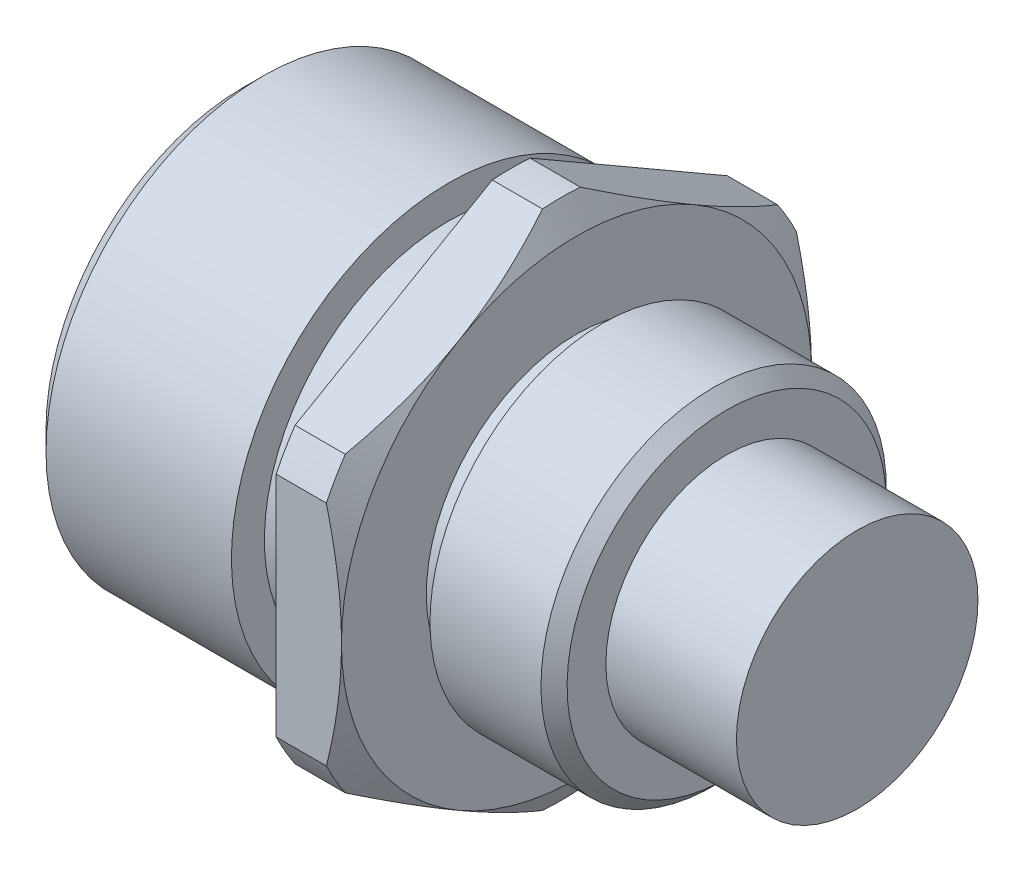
ISO-10303-21;
HEADER;
FILE_DESCRIPTION(('STEP AP214'),'2;1');
FILE_NAME('part.step','',(''),(''),'','','');
FILE_SCHEMA(('AUTOMOTIVE_DESIGN { 1 0 10303 214 1 1 1 1 }'));
ENDSEC;
DATA;
#1=APPLICATION_CONTEXT('core data for automotive mechanical design processes');
#2=APPLICATION_PROTOCOL_DEFINITION('international standard','automotive_design',2000,#1);
#3=PRODUCT_CONTEXT('',#1,'mechanical');
#4=PRODUCT('Part','Part','',(#3));
#5=PRODUCT_RELATED_PRODUCT_CATEGORY('part','',(#4));
#6=PRODUCT_DEFINITION_FORMATION('','',#4);
#7=PRODUCT_DEFINITION_CONTEXT('part definition',#1,'design');
#8=PRODUCT_DEFINITION('design','',#6,#7);
#9=PRODUCT_DEFINITION_SHAPE('','',#8);
#10=(LENGTH_UNIT() NAMED_UNIT(*) SI_UNIT(.MILLI.,.METRE.));
#11=(NAMED_UNIT(*) PLANE_ANGLE_UNIT() SI_UNIT($,.RADIAN.));
#12=(NAMED_UNIT(*) SI_UNIT($,.STERADIAN.) SOLID_ANGLE_UNIT());
#13=UNCERTAINTY_MEASURE_WITH_UNIT(LENGTH_MEASURE(1.E-05),#10,'distance_accuracy_value','');
#14=(GEOMETRIC_REPRESENTATION_CONTEXT(3) GLOBAL_UNCERTAINTY_ASSIGNED_CONTEXT((#13)) GLOBAL_UNIT_ASSIGNED_CONTEXT((#10,
#11,#12)) REPRESENTATION_CONTEXT('',''));
#15=CARTESIAN_POINT('',(0.,0.,0.));
#16=DIRECTION('',(0.,0.,1.));
#17=DIRECTION('',(1.,0.,0.));
#18=AXIS2_PLACEMENT_3D('',#15,#16,#17);
#19=CARTESIAN_POINT('',(10.,0.,0.));
#20=DIRECTION('',(-1.,0.,0.));
#21=DIRECTION('',(0.,-1.,0.));
#22=AXIS2_PLACEMENT_3D('',#19,#20,#21);
#23=CYLINDRICAL_SURFACE('',#22,9.25);
#24=CARTESIAN_POINT('',(10.,0.,0.));
#25=DIRECTION('',(1.,0.,0.));
#26=DIRECTION('',(0.,1.,0.));
#27=AXIS2_PLACEMENT_3D('',#24,#25,#26);
#28=CIRCLE('',#27,9.25);
#29=CARTESIAN_POINT('',(10.,9.25,0.));
#30=VERTEX_POINT('',#29);
#31=EDGE_CURVE('P0_E10',#30,#30,#28,.T.);
#32=ORIENTED_EDGE('',*,*,#31,.F.);
#33=EDGE_LOOP('',(#32));
#34=FACE_BOUND('',#33,.T.);
#35=CARTESIAN_POINT('',(0.,0.,0.));
#36=DIRECTION('',(1.,0.,0.));
#37=DIRECTION('',(0.,1.,0.));
#38=AXIS2_PLACEMENT_3D('',#35,#36,#37);
#39=CIRCLE('',#38,9.25);
#40=CARTESIAN_POINT('',(0.,9.25,0.));
#41=VERTEX_POINT('',#40);
#42=EDGE_CURVE('P0_E32',#41,#41,#39,.T.);
#43=ORIENTED_EDGE('',*,*,#42,.T.);
#44=EDGE_LOOP('',(#43));
#45=FACE_BOUND('',#44,.T.);
#46=ADVANCED_FACE('P0_F29',(#34,#45),#23,.T.);
#47=CARTESIAN_POINT('',(10.,0.,0.));
#48=DIRECTION('',(1.,0.,0.));
#49=DIRECTION('',(0.,1.,0.));
#50=AXIS2_PLACEMENT_3D('',#47,#48,#49);
#51=PLANE('',#50);
#52=ORIENTED_EDGE('',*,*,#31,.T.);
#53=EDGE_LOOP('',(#52));
#54=FACE_BOUND('',#53,.T.);
#55=ADVANCED_FACE('P0_F44',(#54),#51,.T.);
#56=CARTESIAN_POINT('',(0.,0.,0.));
#57=DIRECTION('',(1.,0.,0.));
#58=DIRECTION('',(0.,1.,0.));
#59=AXIS2_PLACEMENT_3D('',#56,#57,#58);
#60=PLANE('',#59);
#61=ORIENTED_EDGE('',*,*,#42,.F.);
#62=EDGE_LOOP('',(#61));
#63=FACE_BOUND('',#62,.T.);
#64=ADVANCED_FACE('P0_F42',(#63),#60,.F.);
#65=CLOSED_SHELL('',(#46,#55,#64));
#66=MANIFOLD_SOLID_BREP('P0_B2',#65);
#67=CARTESIAN_POINT('',(-11.5,0.,0.));
#68=DIRECTION('',(-1.,0.,0.));
#69=DIRECTION('',(0.,-1.,0.));
#70=AXIS2_PLACEMENT_3D('',#67,#68,#69);
#71=CONICAL_SURFACE('',#70,18.,1.0471975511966);
#72=CARTESIAN_POINT('',(-12.6547005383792,0.,0.));
#73=DIRECTION('',(1.,0.,0.));
#74=DIRECTION('',(0.,1.,0.));
#75=AXIS2_PLACEMENT_3D('',#72,#73,#74);
#76=CIRCLE('',#75,20.);
#77=CARTESIAN_POINT('',(-12.6547005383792,8.71779788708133,-18.));
#78=VERTEX_POINT('',#77);
#79=CARTESIAN_POINT('',(-12.6547005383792,11.2295583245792,-16.5498344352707));
#80=VERTEX_POINT('',#79);
#81=EDGE_CURVE('P1_E246',#78,#80,#76,.T.);
#82=ORIENTED_EDGE('',*,*,#81,.T.);
#83=CARTESIAN_POINT('',(-12.6549005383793,11.2291609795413,-16.5505226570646));
#84=CARTESIAN_POINT('',(-12.5432286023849,11.4510030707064,-16.1662808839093));
#85=CARTESIAN_POINT('',(-12.4380456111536,11.6736885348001,-15.780578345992));
#86=CARTESIAN_POINT('',(-12.2421753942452,12.1207153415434,-15.0063052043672));
#87=CARTESIAN_POINT('',(-12.151492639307,12.3450571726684,-14.6177337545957));
#88=CARTESIAN_POINT('',(-11.9860966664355,12.7955417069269,-13.8374716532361));
#89=CARTESIAN_POINT('',(-11.9114057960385,13.0216864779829,-13.4457774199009));
#90=CARTESIAN_POINT('',(-11.7796233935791,13.4752388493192,-12.6602016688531));
#91=CARTESIAN_POINT('',(-11.7225300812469,13.7026463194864,-12.2663203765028));
#92=CARTESIAN_POINT('',(-11.6281664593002,14.1537413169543,-11.4850009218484));
#93=CARTESIAN_POINT('',(-11.5905107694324,14.3774085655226,-11.0975978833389));
#94=CARTESIAN_POINT('',(-11.5341212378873,14.8253501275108,-10.3217403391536));
#95=CARTESIAN_POINT('',(-11.5153880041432,15.0496244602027,-9.93328580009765));
#96=CARTESIAN_POINT('',(-11.4973026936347,15.4981814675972,-9.15636227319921));
#97=CARTESIAN_POINT('',(-11.4979342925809,15.7224639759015,-8.76789357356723));
#98=CARTESIAN_POINT('',(-11.5185181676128,16.1707884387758,-7.99137282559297));
#99=CARTESIAN_POINT('',(-11.5384692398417,16.3948304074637,-7.60332075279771));
#100=CARTESIAN_POINT('',(-11.6044909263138,16.8975940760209,-6.73250853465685));
#101=CARTESIAN_POINT('',(-11.6557979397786,17.1761459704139,-6.25004250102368));
#102=CARTESIAN_POINT('',(-11.7859808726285,17.7316768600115,-5.28783477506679));
#103=CARTESIAN_POINT('',(-11.8648629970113,18.008655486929,-4.80809372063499));
#104=CARTESIAN_POINT('',(-12.0489456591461,18.5641863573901,-3.84588602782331));
#105=CARTESIAN_POINT('',(-12.1544829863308,18.8427103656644,-3.36346829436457));
#106=CARTESIAN_POINT('',(-12.388337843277,19.3971791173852,-2.40310024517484));
#107=CARTESIAN_POINT('',(-12.5166406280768,19.6731254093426,-1.92514724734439));
#108=CARTESIAN_POINT('',(-12.6549005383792,19.9477535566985,-1.44947734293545));
#109=B_SPLINE_CURVE_WITH_KNOTS('',3,(#83,#84,#85,#86,#87,#88,#89,#90,#91,#92,#93,#94,#95,#96,
#97,#98,#99,#100,#101,#102,#103,#104,#105,#106,#107,#108),.UNSPECIFIED.,.F.,.F.,(4,2,2,2,2,2,2,
2,2,2,2,2,4),(0.,1.3725940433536,2.74561047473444,4.12053325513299,5.4953168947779,
6.84168124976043,8.18808885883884,9.53336149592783,10.8785503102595,12.5561717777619,
14.2341709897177,15.934536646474,17.6338049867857),.UNSPECIFIED.);
#110=CARTESIAN_POINT('',(-11.5,15.5884572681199,-9.));
#111=VERTEX_POINT('',#110);
#112=EDGE_CURVE('P1_E367',#80,#111,#109,.T.);
#113=ORIENTED_EDGE('',*,*,#112,.T.);
#114=CARTESIAN_POINT('',(-11.5,0.,0.));
#115=DIRECTION('',(1.,0.,0.));
#116=DIRECTION('',(0.,1.,0.));
#117=AXIS2_PLACEMENT_3D('',#114,#115,#116);
#118=CIRCLE('',#117,18.);
#119=CARTESIAN_POINT('',(-11.5,0.,-18.));
#120=VERTEX_POINT('',#119);
#121=EDGE_CURVE('P1_E154',#120,#111,#118,.T.);
#122=ORIENTED_EDGE('',*,*,#121,.F.);
#123=CARTESIAN_POINT('',(-20.0831428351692,-27.4991426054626,-18.));
#124=CARTESIAN_POINT('',(-19.8923878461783,-27.1042498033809,-18.));
#125=CARTESIAN_POINT('',(-19.7026251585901,-26.708877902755,-18.));
#126=CARTESIAN_POINT('',(-19.3253123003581,-25.9170746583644,-18.));
#127=CARTESIAN_POINT('',(-19.1377621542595,-25.5206433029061,-18.));
#128=CARTESIAN_POINT('',(-18.5787176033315,-24.3294911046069,-18.));
#129=CARTESIAN_POINT('',(-18.210891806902,-23.5330415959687,-18.));
#130=CARTESIAN_POINT('',(-17.485292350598,-21.9300278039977,-18.));
#131=CARTESIAN_POINT('',(-17.1275888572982,-21.1234316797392,-18.));
#132=CARTESIAN_POINT('',(-16.4276306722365,-19.5035874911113,-18.));
#133=CARTESIAN_POINT('',(-16.0853751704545,-18.6903397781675,-18.));
#134=CARTESIAN_POINT('',(-15.416489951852,-17.0460964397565,-18.));
#135=CARTESIAN_POINT('',(-15.0900950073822,-16.2150048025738,-18.));
#136=CARTESIAN_POINT('',(-14.4630243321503,-14.5429906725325,-18.));
#137=CARTESIAN_POINT('',(-14.162351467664,-13.702067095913,-18.));
#138=CARTESIAN_POINT('',(-13.5948538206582,-12.0108273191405,-18.));
#139=CARTESIAN_POINT('',(-13.3279565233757,-11.160535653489,-18.));
#140=CARTESIAN_POINT('',(-12.8367057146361,-9.4477849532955,-18.));
#141=CARTESIAN_POINT('',(-12.6123386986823,-8.58532987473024,-18.));
#142=CARTESIAN_POINT('',(-12.3159268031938,-7.28235631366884,-18.));
#143=CARTESIAN_POINT('',(-12.2237952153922,-6.84637691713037,-18.));
#144=CARTESIAN_POINT('',(-12.0543745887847,-5.97152919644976,-18.));
#145=CARTESIAN_POINT('',(-11.9770852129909,-5.53266093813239,-18.));
#146=CARTESIAN_POINT('',(-11.8387227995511,-4.65233465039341,-18.));
#147=CARTESIAN_POINT('',(-11.7776507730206,-4.21087646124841,-18.));
#148=CARTESIAN_POINT('',(-11.6729517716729,-3.32588120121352,-18.));
#149=CARTESIAN_POINT('',(-11.6293248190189,-2.88234412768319,-18.));
#150=CARTESIAN_POINT('',(-11.5606870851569,-1.99661694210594,-18.));
#151=CARTESIAN_POINT('',(-11.5355614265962,-1.55443579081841,-18.));
#152=CARTESIAN_POINT('',(-11.5040574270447,-0.669408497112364,-18.));
#153=CARTESIAN_POINT('',(-11.4976788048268,-0.226562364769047,-18.));
#154=CARTESIAN_POINT('',(-11.503819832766,0.658879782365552,-18.));
#155=CARTESIAN_POINT('',(-11.5163343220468,1.10147583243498,-18.));
#156=CARTESIAN_POINT('',(-11.5599522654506,1.98575279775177,-18.));
#157=CARTESIAN_POINT('',(-11.5910565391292,2.42743367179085,-18.));
#158=CARTESIAN_POINT('',(-11.6884816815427,3.49963238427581,-18.));
#159=CARTESIAN_POINT('',(-11.7642107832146,4.12931183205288,-18.));
#160=CARTESIAN_POINT('',(-11.9492205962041,5.38369556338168,-18.));
#161=CARTESIAN_POINT('',(-12.0585063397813,6.00839908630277,-18.));
#162=CARTESIAN_POINT('',(-12.4312120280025,7.8761564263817,-18.));
#163=CARTESIAN_POINT('',(-12.7392300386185,9.1104114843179,-18.));
#164=CARTESIAN_POINT('',(-13.2698190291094,10.9565279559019,-18.));
#165=CARTESIAN_POINT('',(-13.460684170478,11.5780480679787,-18.));
#166=CARTESIAN_POINT('',(-13.8613113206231,12.815083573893,-18.));
#167=CARTESIAN_POINT('',(-14.0710750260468,13.4305984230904,-18.));
#168=CARTESIAN_POINT('',(-14.5050398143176,14.65255311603,-18.));
#169=CARTESIAN_POINT('',(-14.7291525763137,15.2590245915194,-18.));
#170=CARTESIAN_POINT('',(-15.0749595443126,16.1649196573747,-18.));
#171=CARTESIAN_POINT('',(-15.1918151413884,16.466200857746,-18.));
#172=CARTESIAN_POINT('',(-15.4284778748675,17.0675954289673,-18.));
#173=CARTESIAN_POINT('',(-15.5482849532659,17.3677088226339,-18.));
#174=CARTESIAN_POINT('',(-15.6694343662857,17.667278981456,-18.));
#175=B_SPLINE_CURVE_WITH_KNOTS('',3,(#123,#124,#125,#126,#127,#128,#129,#130,#131,#132,#133,
#134,#135,#136,#137,#138,#139,#140,#141,#142,#143,#144,#145,#146,#147,#148,#149,#150,#151,#152,
#153,#154,#155,#156,#157,#158,#159,#160,#161,#162,#163,#164,#165,#166,#167,#168,#169,#170,#171,
#172,#173,#174),.UNSPECIFIED.,.F.,.F.,(4,2,2,2,2,2,2,2,2,2,2,2,2,2,2,2,2,2,2,2,2,2,2,2,2,4),(0.,
1.31565319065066,2.63132096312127,5.26308805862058,7.91002567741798,10.5568243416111,
13.2351598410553,15.913793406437,18.5865748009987,21.2585060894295,22.595117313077,
23.9316981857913,25.2683623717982,26.6050282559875,27.9333229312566,29.2615976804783,
30.5895096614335,31.9174801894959,33.8190492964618,35.7209037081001,39.5319547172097,
41.4823037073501,43.4328279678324,45.3723255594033,46.3417605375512,47.3111764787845),.UNSPECIFIED.);
#176=EDGE_CURVE('P1_E277',#120,#78,#175,.T.);
#177=ORIENTED_EDGE('',*,*,#176,.T.);
#178=EDGE_LOOP('',(#82,#113,#122,#177));
#179=FACE_BOUND('',#178,.T.);
#180=ADVANCED_FACE('P1_F17',(#179),#71,.T.);
#181=CARTESIAN_POINT('',(-11.5,15.5884572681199,9.));
#182=VERTEX_POINT('',#181);
#183=EDGE_CURVE('P1_E141',#111,#182,#118,.T.);
#184=ORIENTED_EDGE('',*,*,#183,.F.);
#185=CARTESIAN_POINT('',(-12.6547005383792,19.9473562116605,-1.45016556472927));
#186=VERTEX_POINT('',#185);
#187=EDGE_CURVE('P1_E373',#111,#186,#109,.T.);
#188=ORIENTED_EDGE('',*,*,#187,.T.);
#189=CARTESIAN_POINT('',(-12.6547005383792,19.9473562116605,1.45016556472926));
#190=VERTEX_POINT('',#189);
#191=EDGE_CURVE('P1_E144',#186,#190,#76,.T.);
#192=ORIENTED_EDGE('',*,*,#191,.T.);
#193=CARTESIAN_POINT('',(-12.6549005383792,19.9477535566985,1.44947734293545));
#194=CARTESIAN_POINT('',(-12.5432286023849,19.7259114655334,1.83371911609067));
#195=CARTESIAN_POINT('',(-12.4380456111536,19.5032260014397,2.21942165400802));
#196=CARTESIAN_POINT('',(-12.2421753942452,19.0561991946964,2.99369479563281));
#197=CARTESIAN_POINT('',(-12.151492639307,18.8318573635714,3.38226624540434));
#198=CARTESIAN_POINT('',(-11.9860966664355,18.3813728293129,4.16252834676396));
#199=CARTESIAN_POINT('',(-11.9114057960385,18.1552280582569,4.5542225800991));
#200=CARTESIAN_POINT('',(-11.7796233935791,17.7016756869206,5.33979833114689));
#201=CARTESIAN_POINT('',(-11.7225300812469,17.4742682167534,5.73367962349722));
#202=CARTESIAN_POINT('',(-11.6281664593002,17.0231732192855,6.51499907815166));
#203=CARTESIAN_POINT('',(-11.5905107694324,16.7995059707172,6.90240211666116));
#204=CARTESIAN_POINT('',(-11.5341212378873,16.351564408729,7.67825966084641));
#205=CARTESIAN_POINT('',(-11.5153880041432,16.1272900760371,8.06671419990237));
#206=CARTESIAN_POINT('',(-11.4973026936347,15.6787330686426,8.84363772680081));
#207=CARTESIAN_POINT('',(-11.4979342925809,15.4544505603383,9.2321064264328));
#208=CARTESIAN_POINT('',(-11.5185181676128,15.006126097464,10.0086271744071));
#209=CARTESIAN_POINT('',(-11.5384692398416,14.7820841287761,10.3966792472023));
#210=CARTESIAN_POINT('',(-11.6044909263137,14.2793204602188,11.2674914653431));
#211=CARTESIAN_POINT('',(-11.6557979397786,14.0007685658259,11.7499574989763));
#212=CARTESIAN_POINT('',(-11.7859808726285,13.4452376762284,12.7121652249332));
#213=CARTESIAN_POINT('',(-11.8648629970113,13.1682590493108,13.191906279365));
#214=CARTESIAN_POINT('',(-12.0489456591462,12.6127281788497,14.1541139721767));
#215=CARTESIAN_POINT('',(-12.1544829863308,12.3342041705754,14.6365317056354));
#216=CARTESIAN_POINT('',(-12.388337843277,11.7797354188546,15.5968997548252));
#217=CARTESIAN_POINT('',(-12.5166406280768,11.5037891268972,16.0748527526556));
#218=CARTESIAN_POINT('',(-12.6549005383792,11.2291609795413,16.5505226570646));
#219=B_SPLINE_CURVE_WITH_KNOTS('',3,(#193,#194,#195,#196,#197,#198,#199,#200,#201,#202,#203,
#204,#205,#206,#207,#208,#209,#210,#211,#212,#213,#214,#215,#216,#217,#218),.UNSPECIFIED.,.F.,
.F.,(4,2,2,2,2,2,2,2,2,2,2,2,4),(0.,1.37259404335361,2.74561047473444,4.120533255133,
5.49531689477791,6.84168124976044,8.18808885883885,9.53336149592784,10.8785503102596,
12.5561717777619,14.2341709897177,15.934536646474,17.6338049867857),.UNSPECIFIED.);
#220=EDGE_CURVE('P1_E126',#190,#182,#219,.T.);
#221=ORIENTED_EDGE('',*,*,#220,.T.);
#222=EDGE_LOOP('',(#184,#188,#192,#221));
#223=FACE_BOUND('',#222,.T.);
#224=ADVANCED_FACE('P1_F139',(#223),#71,.T.);
#225=CARTESIAN_POINT('',(-12.6547005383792,-11.2295583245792,-16.5498344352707));
#226=VERTEX_POINT('',#225);
#227=CARTESIAN_POINT('',(-12.6547005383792,-8.71779788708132,-18.));
#228=VERTEX_POINT('',#227);
#229=EDGE_CURVE('P1_E362',#226,#228,#76,.T.);
#230=ORIENTED_EDGE('',*,*,#229,.T.);
#231=EDGE_CURVE('P1_E279',#228,#120,#175,.T.);
#232=ORIENTED_EDGE('',*,*,#231,.T.);
#233=CARTESIAN_POINT('',(-11.5,-15.5884572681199,-9.));
#234=VERTEX_POINT('',#233);
#235=EDGE_CURVE('P1_E370',#234,#120,#118,.T.);
#236=ORIENTED_EDGE('',*,*,#235,.F.);
#237=CARTESIAN_POINT('',(-12.6549005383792,-19.9477535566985,-1.44947734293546));
#238=CARTESIAN_POINT('',(-12.5432286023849,-19.7259114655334,-1.83371911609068));
#239=CARTESIAN_POINT('',(-12.4380456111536,-19.5032260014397,-2.21942165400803));
#240=CARTESIAN_POINT('',(-12.2421753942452,-19.0561991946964,-2.99369479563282));
#241=CARTESIAN_POINT('',(-12.151492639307,-18.8318573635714,-3.38226624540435));
#242=CARTESIAN_POINT('',(-11.9860966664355,-18.3813728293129,-4.16252834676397));
#243=CARTESIAN_POINT('',(-11.9114057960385,-18.1552280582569,-4.55422258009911));
#244=CARTESIAN_POINT('',(-11.7796233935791,-17.7016756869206,-5.33979833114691));
#245=CARTESIAN_POINT('',(-11.7225300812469,-17.4742682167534,-5.73367962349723));
#246=CARTESIAN_POINT('',(-11.6281664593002,-17.0231732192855,-6.51499907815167));
#247=CARTESIAN_POINT('',(-11.5905107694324,-16.7995059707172,-6.90240211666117));
#248=CARTESIAN_POINT('',(-11.5341212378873,-16.351564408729,-7.67825966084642));
#249=CARTESIAN_POINT('',(-11.5153880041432,-16.1272900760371,-8.06671419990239));
#250=CARTESIAN_POINT('',(-11.4973026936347,-15.6787330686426,-8.84363772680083));
#251=CARTESIAN_POINT('',(-11.4979342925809,-15.4544505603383,-9.23210642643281));
#252=CARTESIAN_POINT('',(-11.5185181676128,-15.006126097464,-10.0086271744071));
#253=CARTESIAN_POINT('',(-11.5384692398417,-14.7820841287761,-10.3966792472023));
#254=CARTESIAN_POINT('',(-11.6044909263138,-14.2793204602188,-11.2674914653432));
#255=CARTESIAN_POINT('',(-11.6557979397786,-14.0007685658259,-11.7499574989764));
#256=CARTESIAN_POINT('',(-11.7859808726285,-13.4452376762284,-12.7121652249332));
#257=CARTESIAN_POINT('',(-11.8648629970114,-13.1682590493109,-13.191906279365));
#258=CARTESIAN_POINT('',(-12.0489456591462,-12.6127281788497,-14.1541139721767));
#259=CARTESIAN_POINT('',(-12.1544829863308,-12.3342041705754,-14.6365317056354));
#260=CARTESIAN_POINT('',(-12.388337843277,-11.7797354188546,-15.5968997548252));
#261=CARTESIAN_POINT('',(-12.5166406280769,-11.5037891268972,-16.0748527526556));
#262=CARTESIAN_POINT('',(-12.6549005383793,-11.2291609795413,-16.5505226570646));
#263=B_SPLINE_CURVE_WITH_KNOTS('',3,(#237,#238,#239,#240,#241,#242,#243,#244,#245,#246,#247,
#248,#249,#250,#251,#252,#253,#254,#255,#256,#257,#258,#259,#260,#261,#262),.UNSPECIFIED.,.F.,
.F.,(4,2,2,2,2,2,2,2,2,2,2,2,4),(0.,1.3725940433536,2.74561047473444,4.120533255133,
5.4953168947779,6.84168124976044,8.18808885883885,9.53336149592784,10.8785503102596,
12.5561717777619,14.2341709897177,15.934536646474,17.6338049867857),.UNSPECIFIED.);
#264=EDGE_CURVE('P1_E307',#234,#226,#263,.T.);
#265=ORIENTED_EDGE('',*,*,#264,.T.);
#266=EDGE_LOOP('',(#230,#232,#236,#265));
#267=FACE_BOUND('',#266,.T.);
#268=ADVANCED_FACE('P1_F369',(#267),#71,.T.);
#269=CARTESIAN_POINT('',(-12.6547005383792,-19.9473562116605,1.45016556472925));
#270=VERTEX_POINT('',#269);
#271=CARTESIAN_POINT('',(-12.6547005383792,-19.9473562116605,-1.45016556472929));
#272=VERTEX_POINT('',#271);
#273=EDGE_CURVE('P1_E359',#270,#272,#76,.T.);
#274=ORIENTED_EDGE('',*,*,#273,.T.);
#275=EDGE_CURVE('P1_E281',#272,#234,#263,.T.);
#276=ORIENTED_EDGE('',*,*,#275,.T.);
#277=CARTESIAN_POINT('',(-11.5,-15.5884572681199,9.));
#278=VERTEX_POINT('',#277);
#279=EDGE_CURVE('P1_E166',#278,#234,#118,.T.);
#280=ORIENTED_EDGE('',*,*,#279,.F.);
#281=CARTESIAN_POINT('',(-12.6549005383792,-11.2291609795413,16.5505226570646));
#282=CARTESIAN_POINT('',(-12.5432286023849,-11.4510030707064,16.1662808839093));
#283=CARTESIAN_POINT('',(-12.4380456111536,-11.6736885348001,15.780578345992));
#284=CARTESIAN_POINT('',(-12.2421753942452,-12.1207153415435,15.0063052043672));
#285=CARTESIAN_POINT('',(-12.151492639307,-12.3450571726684,14.6177337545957));
#286=CARTESIAN_POINT('',(-11.9860966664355,-12.7955417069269,13.8374716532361));
#287=CARTESIAN_POINT('',(-11.9114057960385,-13.0216864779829,13.4457774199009));
#288=CARTESIAN_POINT('',(-11.7796233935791,-13.4752388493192,12.6602016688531));
#289=CARTESIAN_POINT('',(-11.7225300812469,-13.7026463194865,12.2663203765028));
#290=CARTESIAN_POINT('',(-11.6281664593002,-14.1537413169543,11.4850009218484));
#291=CARTESIAN_POINT('',(-11.5905107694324,-14.3774085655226,11.0975978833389));
#292=CARTESIAN_POINT('',(-11.5341212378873,-14.8253501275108,10.3217403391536));
#293=CARTESIAN_POINT('',(-11.5153880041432,-15.0496244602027,9.93328580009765));
#294=CARTESIAN_POINT('',(-11.4973026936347,-15.4981814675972,9.15636227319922));
#295=CARTESIAN_POINT('',(-11.4979342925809,-15.7224639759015,8.76789357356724));
#296=CARTESIAN_POINT('',(-11.5185181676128,-16.1707884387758,7.99137282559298));
#297=CARTESIAN_POINT('',(-11.5384692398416,-16.3948304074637,7.60332075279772));
#298=CARTESIAN_POINT('',(-11.6044909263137,-16.8975940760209,6.73250853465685));
#299=CARTESIAN_POINT('',(-11.6557979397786,-17.1761459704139,6.25004250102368));
#300=CARTESIAN_POINT('',(-11.7859808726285,-17.7316768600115,5.28783477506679));
#301=CARTESIAN_POINT('',(-11.8648629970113,-18.008655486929,4.80809372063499));
#302=CARTESIAN_POINT('',(-12.0489456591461,-18.5641863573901,3.8458860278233));
#303=CARTESIAN_POINT('',(-12.1544829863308,-18.8427103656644,3.36346829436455));
#304=CARTESIAN_POINT('',(-12.388337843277,-19.3971791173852,2.40310024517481));
#305=CARTESIAN_POINT('',(-12.5166406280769,-19.6731254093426,1.92514724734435));
#306=CARTESIAN_POINT('',(-12.6549005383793,-19.9477535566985,1.4494773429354));
#307=B_SPLINE_CURVE_WITH_KNOTS('',3,(#281,#282,#283,#284,#285,#286,#287,#288,#289,#290,#291,
#292,#293,#294,#295,#296,#297,#298,#299,#300,#301,#302,#303,#304,#305,#306),.UNSPECIFIED.,.F.,
.F.,(4,2,2,2,2,2,2,2,2,2,2,2,4),(0.,1.3725940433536,2.74561047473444,4.12053325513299,
5.49531689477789,6.84168124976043,8.18808885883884,9.53336149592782,10.8785503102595,
12.5561717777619,14.2341709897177,15.934536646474,17.6338049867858),.UNSPECIFIED.);
#308=EDGE_CURVE('P1_E317',#278,#270,#307,.T.);
#309=ORIENTED_EDGE('',*,*,#308,.T.);
#310=EDGE_LOOP('',(#274,#276,#280,#309));
#311=FACE_BOUND('',#310,.T.);
#312=ADVANCED_FACE('P1_F413',(#311),#71,.T.);
#313=CARTESIAN_POINT('',(-12.6547005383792,-8.71779788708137,18.));
#314=VERTEX_POINT('',#313);
#315=CARTESIAN_POINT('',(-12.6547005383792,-11.2295583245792,16.5498344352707));
#316=VERTEX_POINT('',#315);
#317=EDGE_CURVE('P1_E354',#314,#316,#76,.T.);
#318=ORIENTED_EDGE('',*,*,#317,.T.);
#319=EDGE_CURVE('P1_E316',#316,#278,#307,.T.);
#320=ORIENTED_EDGE('',*,*,#319,.T.);
#321=CARTESIAN_POINT('',(-11.5,0.,18.));
#322=VERTEX_POINT('',#321);
#323=EDGE_CURVE('P1_E162',#322,#278,#118,.T.);
#324=ORIENTED_EDGE('',*,*,#323,.F.);
#325=CARTESIAN_POINT('',(-20.0831428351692,-27.4991426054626,18.));
#326=CARTESIAN_POINT('',(-19.8923878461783,-27.1042498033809,18.));
#327=CARTESIAN_POINT('',(-19.7026251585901,-26.708877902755,18.));
#328=CARTESIAN_POINT('',(-19.3253123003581,-25.9170746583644,18.));
#329=CARTESIAN_POINT('',(-19.1377621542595,-25.5206433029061,18.));
#330=CARTESIAN_POINT('',(-18.5787176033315,-24.3294911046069,18.));
#331=CARTESIAN_POINT('',(-18.210891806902,-23.5330415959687,18.));
#332=CARTESIAN_POINT('',(-17.485292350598,-21.9300278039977,18.));
#333=CARTESIAN_POINT('',(-17.1275888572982,-21.1234316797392,18.));
#334=CARTESIAN_POINT('',(-16.4276306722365,-19.5035874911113,18.));
#335=CARTESIAN_POINT('',(-16.0853751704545,-18.6903397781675,18.));
#336=CARTESIAN_POINT('',(-15.4164899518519,-17.0460964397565,18.));
#337=CARTESIAN_POINT('',(-15.0900950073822,-16.2150048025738,18.));
#338=CARTESIAN_POINT('',(-14.4630243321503,-14.5429906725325,18.));
#339=CARTESIAN_POINT('',(-14.162351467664,-13.702067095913,18.));
#340=CARTESIAN_POINT('',(-13.5948538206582,-12.0108273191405,18.));
#341=CARTESIAN_POINT('',(-13.3279565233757,-11.160535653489,18.));
#342=CARTESIAN_POINT('',(-12.8367057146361,-9.44778495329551,18.));
#343=CARTESIAN_POINT('',(-12.6123386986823,-8.58532987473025,18.));
#344=CARTESIAN_POINT('',(-12.3159268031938,-7.28235631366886,18.));
#345=CARTESIAN_POINT('',(-12.2237952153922,-6.84637691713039,18.));
#346=CARTESIAN_POINT('',(-12.0543745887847,-5.97152919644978,18.));
#347=CARTESIAN_POINT('',(-11.9770852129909,-5.53266093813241,18.));
#348=CARTESIAN_POINT('',(-11.8387227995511,-4.65233465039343,18.));
#349=CARTESIAN_POINT('',(-11.7776507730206,-4.21087646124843,18.));
#350=CARTESIAN_POINT('',(-11.6729517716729,-3.32588120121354,18.));
#351=CARTESIAN_POINT('',(-11.6293248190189,-2.88234412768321,18.));
#352=CARTESIAN_POINT('',(-11.5606870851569,-1.99661694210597,18.));
#353=CARTESIAN_POINT('',(-11.5355614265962,-1.55443579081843,18.));
#354=CARTESIAN_POINT('',(-11.5040574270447,-0.669408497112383,18.));
#355=CARTESIAN_POINT('',(-11.4976788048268,-0.226562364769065,18.));
#356=CARTESIAN_POINT('',(-11.503819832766,0.658879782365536,18.));
#357=CARTESIAN_POINT('',(-11.5163343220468,1.10147583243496,18.));
#358=CARTESIAN_POINT('',(-11.5599522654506,1.98575279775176,18.));
#359=CARTESIAN_POINT('',(-11.5910565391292,2.42743367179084,18.));
#360=CARTESIAN_POINT('',(-11.6884816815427,3.4996323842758,18.));
#361=CARTESIAN_POINT('',(-11.7642107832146,4.12931183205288,18.));
#362=CARTESIAN_POINT('',(-11.9492205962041,5.38369556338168,18.));
#363=CARTESIAN_POINT('',(-12.0585063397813,6.00839908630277,18.));
#364=CARTESIAN_POINT('',(-12.4312120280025,7.87615642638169,18.));
#365=CARTESIAN_POINT('',(-12.7392300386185,9.1104114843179,18.));
#366=CARTESIAN_POINT('',(-13.2698190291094,10.9565279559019,18.));
#367=CARTESIAN_POINT('',(-13.460684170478,11.5780480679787,18.));
#368=CARTESIAN_POINT('',(-13.8613113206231,12.815083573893,18.));
#369=CARTESIAN_POINT('',(-14.0710750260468,13.4305984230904,18.));
#370=CARTESIAN_POINT('',(-14.5050398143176,14.65255311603,18.));
#371=CARTESIAN_POINT('',(-14.7291525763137,15.2590245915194,18.));
#372=CARTESIAN_POINT('',(-15.0749595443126,16.1649196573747,18.));
#373=CARTESIAN_POINT('',(-15.1918151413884,16.466200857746,18.));
#374=CARTESIAN_POINT('',(-15.4284778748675,17.0675954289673,18.));
#375=CARTESIAN_POINT('',(-15.5482849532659,17.3677088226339,18.));
#376=CARTESIAN_POINT('',(-15.6694343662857,17.667278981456,18.));
#377=B_SPLINE_CURVE_WITH_KNOTS('',3,(#325,#326,#327,#328,#329,#330,#331,#332,#333,#334,#335,
#336,#337,#338,#339,#340,#341,#342,#343,#344,#345,#346,#347,#348,#349,#350,#351,#352,#353,#354,
#355,#356,#357,#358,#359,#360,#361,#362,#363,#364,#365,#366,#367,#368,#369,#370,#371,#372,#373,
#374,#375,#376),.UNSPECIFIED.,.F.,.F.,(4,2,2,2,2,2,2,2,2,2,2,2,2,2,2,2,2,2,2,2,2,2,2,2,2,4),(0.,
1.31565319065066,2.63132096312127,5.26308805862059,7.91002567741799,10.5568243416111,
13.2351598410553,15.913793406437,18.5865748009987,21.2585060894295,22.595117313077,
23.9316981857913,25.2683623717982,26.6050282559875,27.9333229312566,29.2615976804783,
30.5895096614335,31.9174801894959,33.8190492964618,35.7209037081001,39.5319547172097,
41.4823037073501,43.4328279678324,45.3723255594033,46.3417605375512,47.3111764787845),.UNSPECIFIED.);
#378=EDGE_CURVE('P1_E327',#322,#314,#377,.F.);
#379=ORIENTED_EDGE('',*,*,#378,.T.);
#380=EDGE_LOOP('',(#318,#320,#324,#379));
#381=FACE_BOUND('',#380,.T.);
#382=ADVANCED_FACE('P1_F407',(#381),#71,.T.);
#383=CARTESIAN_POINT('',(-12.6547005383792,11.2295583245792,16.5498344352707));
#384=VERTEX_POINT('',#383);
#385=CARTESIAN_POINT('',(-12.6547005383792,8.71779788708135,18.));
#386=VERTEX_POINT('',#385);
#387=EDGE_CURVE('P1_E155',#384,#386,#76,.T.);
#388=ORIENTED_EDGE('',*,*,#387,.T.);
#389=EDGE_CURVE('P1_E159',#386,#322,#377,.F.);
#390=ORIENTED_EDGE('',*,*,#389,.T.);
#391=EDGE_CURVE('P1_E151',#182,#322,#118,.T.);
#392=ORIENTED_EDGE('',*,*,#391,.F.);
#393=EDGE_CURVE('P1_E123',#182,#384,#219,.T.);
#394=ORIENTED_EDGE('',*,*,#393,.T.);
#395=EDGE_LOOP('',(#388,#390,#392,#394));
#396=FACE_BOUND('',#395,.T.);
#397=ADVANCED_FACE('P1_F158',(#396),#71,.T.);
#398=CARTESIAN_POINT('',(0.,0.,0.));
#399=DIRECTION('',(1.,0.,0.));
#400=DIRECTION('',(0.,1.,0.));
#401=AXIS2_PLACEMENT_3D('',#398,#399,#400);
#402=CYLINDRICAL_SURFACE('',#401,20.);
#403=ORIENTED_EDGE('',*,*,#191,.F.);
#404=DIRECTION('',(1.,0.,0.));
#405=VECTOR('',#404,1.);
#406=CARTESIAN_POINT('',(0.,19.9473562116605,-1.45016556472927));
#407=LINE('',#406,#405);
#408=CARTESIAN_POINT('',(-16.5,19.9473562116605,-1.45016556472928));
#409=VERTEX_POINT('',#408);
#410=EDGE_CURVE('P1_E372',#186,#409,#407,.F.);
#411=ORIENTED_EDGE('',*,*,#410,.T.);
#412=CARTESIAN_POINT('',(-16.5,0.,0.));
#413=DIRECTION('',(1.,0.,0.));
#414=DIRECTION('',(0.,1.,0.));
#415=AXIS2_PLACEMENT_3D('',#412,#413,#414);
#416=CIRCLE('',#415,20.);
#417=CARTESIAN_POINT('',(-16.5,19.9473562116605,1.45016556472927));
#418=VERTEX_POINT('',#417);
#419=EDGE_CURVE('P1_E232',#409,#418,#416,.T.);
#420=ORIENTED_EDGE('',*,*,#419,.T.);
#421=DIRECTION('',(1.,0.,0.));
#422=VECTOR('',#421,1.);
#423=CARTESIAN_POINT('',(0.,19.9473562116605,1.45016556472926));
#424=LINE('',#423,#422);
#425=EDGE_CURVE('P1_E577',#418,#190,#424,.T.);
#426=ORIENTED_EDGE('',*,*,#425,.T.);
#427=EDGE_LOOP('',(#403,#411,#420,#426));
#428=FACE_BOUND('',#427,.T.);
#429=ADVANCED_FACE('P1_F406',(#428),#402,.T.);
#430=CARTESIAN_POINT('',(-16.5,8.71779788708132,-18.));
#431=VERTEX_POINT('',#430);
#432=CARTESIAN_POINT('',(-16.5,11.2295583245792,-16.5498344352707));
#433=VERTEX_POINT('',#432);
#434=EDGE_CURVE('P1_E234',#431,#433,#416,.T.);
#435=ORIENTED_EDGE('',*,*,#434,.T.);
#436=DIRECTION('',(1.,0.,0.));
#437=VECTOR('',#436,1.);
#438=CARTESIAN_POINT('',(0.,11.2295583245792,-16.5498344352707));
#439=LINE('',#438,#437);
#440=EDGE_CURVE('P1_E32',#433,#80,#439,.T.);
#441=ORIENTED_EDGE('',*,*,#440,.T.);
#442=ORIENTED_EDGE('',*,*,#81,.F.);
#443=DIRECTION('',(1.,0.,0.));
#444=VECTOR('',#443,1.);
#445=CARTESIAN_POINT('',(0.,8.71779788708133,-18.));
#446=LINE('',#445,#444);
#447=EDGE_CURVE('P1_E271',#78,#431,#446,.F.);
#448=ORIENTED_EDGE('',*,*,#447,.T.);
#449=EDGE_LOOP('',(#435,#441,#442,#448));
#450=FACE_BOUND('',#449,.T.);
#451=ADVANCED_FACE('P1_F275',(#450),#402,.T.);
#452=CARTESIAN_POINT('',(-16.5,-11.2295583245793,-16.5498344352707));
#453=VERTEX_POINT('',#452);
#454=CARTESIAN_POINT('',(-16.5,-8.71779788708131,-18.));
#455=VERTEX_POINT('',#454);
#456=EDGE_CURVE('P1_E240',#453,#455,#416,.T.);
#457=ORIENTED_EDGE('',*,*,#456,.T.);
#458=DIRECTION('',(1.,0.,0.));
#459=VECTOR('',#458,1.);
#460=CARTESIAN_POINT('',(0.,-8.71779788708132,-18.));
#461=LINE('',#460,#459);
#462=EDGE_CURVE('P1_E40',#455,#228,#461,.T.);
#463=ORIENTED_EDGE('',*,*,#462,.T.);
#464=ORIENTED_EDGE('',*,*,#229,.F.);
#465=DIRECTION('',(1.,0.,0.));
#466=VECTOR('',#465,1.);
#467=CARTESIAN_POINT('',(0.,-11.2295583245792,-16.5498344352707));
#468=LINE('',#467,#466);
#469=EDGE_CURVE('P1_E265',#226,#453,#468,.F.);
#470=ORIENTED_EDGE('',*,*,#469,.T.);
#471=EDGE_LOOP('',(#457,#463,#464,#470));
#472=FACE_BOUND('',#471,.T.);
#473=ADVANCED_FACE('P1_F262',(#472),#402,.T.);
#474=CARTESIAN_POINT('',(-16.5,-19.9473562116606,1.45016556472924));
#475=VERTEX_POINT('',#474);
#476=CARTESIAN_POINT('',(-16.5,-19.9473562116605,-1.4501655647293));
#477=VERTEX_POINT('',#476);
#478=EDGE_CURVE('P1_E248',#475,#477,#416,.T.);
#479=ORIENTED_EDGE('',*,*,#478,.T.);
#480=DIRECTION('',(1.,0.,0.));
#481=VECTOR('',#480,1.);
#482=CARTESIAN_POINT('',(0.,-19.9473562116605,-1.45016556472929));
#483=LINE('',#482,#481);
#484=EDGE_CURVE('P1_E314',#477,#272,#483,.T.);
#485=ORIENTED_EDGE('',*,*,#484,.T.);
#486=ORIENTED_EDGE('',*,*,#273,.F.);
#487=DIRECTION('',(1.,0.,0.));
#488=VECTOR('',#487,1.);
#489=CARTESIAN_POINT('',(0.,-19.9473562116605,1.45016556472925));
#490=LINE('',#489,#488);
#491=EDGE_CURVE('P1_E323',#270,#475,#490,.F.);
#492=ORIENTED_EDGE('',*,*,#491,.T.);
#493=EDGE_LOOP('',(#479,#485,#486,#492));
#494=FACE_BOUND('',#493,.T.);
#495=ADVANCED_FACE('P1_F357',(#494),#402,.T.);
#496=CARTESIAN_POINT('',(-16.5,-8.71779788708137,18.));
#497=VERTEX_POINT('',#496);
#498=CARTESIAN_POINT('',(-16.5,-11.2295583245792,16.5498344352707));
#499=VERTEX_POINT('',#498);
#500=EDGE_CURVE('P1_E242',#497,#499,#416,.T.);
#501=ORIENTED_EDGE('',*,*,#500,.T.);
#502=DIRECTION('',(1.,0.,0.));
#503=VECTOR('',#502,1.);
#504=CARTESIAN_POINT('',(0.,-11.2295583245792,16.5498344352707));
#505=LINE('',#504,#503);
#506=EDGE_CURVE('P1_E325',#499,#316,#505,.T.);
#507=ORIENTED_EDGE('',*,*,#506,.T.);
#508=ORIENTED_EDGE('',*,*,#317,.F.);
#509=DIRECTION('',(1.,0.,0.));
#510=VECTOR('',#509,1.);
#511=CARTESIAN_POINT('',(0.,-8.71779788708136,18.));
#512=LINE('',#511,#510);
#513=EDGE_CURVE('P1_E333',#314,#497,#512,.F.);
#514=ORIENTED_EDGE('',*,*,#513,.T.);
#515=EDGE_LOOP('',(#501,#507,#508,#514));
#516=FACE_BOUND('',#515,.T.);
#517=ADVANCED_FACE('P1_F352',(#516),#402,.T.);
#518=CARTESIAN_POINT('',(-16.5,11.2295583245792,16.5498344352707));
#519=VERTEX_POINT('',#518);
#520=CARTESIAN_POINT('',(-16.5,8.71779788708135,18.));
#521=VERTEX_POINT('',#520);
#522=EDGE_CURVE('P1_E235',#519,#521,#416,.T.);
#523=ORIENTED_EDGE('',*,*,#522,.T.);
#524=DIRECTION('',(1.,0.,0.));
#525=VECTOR('',#524,1.);
#526=CARTESIAN_POINT('',(0.,8.71779788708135,18.));
#527=LINE('',#526,#525);
#528=EDGE_CURVE('P1_E145',#521,#386,#527,.T.);
#529=ORIENTED_EDGE('',*,*,#528,.T.);
#530=ORIENTED_EDGE('',*,*,#387,.F.);
#531=DIRECTION('',(1.,0.,0.));
#532=VECTOR('',#531,1.);
#533=CARTESIAN_POINT('',(0.,11.2295583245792,16.5498344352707));
#534=LINE('',#533,#532);
#535=EDGE_CURVE('P1_E129',#384,#519,#534,.F.);
#536=ORIENTED_EDGE('',*,*,#535,.T.);
#537=EDGE_LOOP('',(#523,#529,#530,#536));
#538=FACE_BOUND('',#537,.T.);
#539=ADVANCED_FACE('P1_F397',(#538),#402,.T.);
#540=CARTESIAN_POINT('',(-16.5,14.1,0.));
#541=DIRECTION('',(-1.,0.,0.));
#542=DIRECTION('',(0.,-1.,0.));
#543=AXIS2_PLACEMENT_3D('',#540,#541,#542);
#544=PLANE('',#543);
#545=CARTESIAN_POINT('',(-16.5,0.,0.));
#546=DIRECTION('',(1.,0.,0.));
#547=DIRECTION('',(0.,1.,0.));
#548=AXIS2_PLACEMENT_3D('',#545,#546,#547);
#549=CIRCLE('',#548,14.1);
#550=CARTESIAN_POINT('',(-16.5,14.1,0.));
#551=VERTEX_POINT('',#550);
#552=EDGE_CURVE('P1_E224',#551,#551,#549,.T.);
#553=ORIENTED_EDGE('',*,*,#552,.T.);
#554=EDGE_LOOP('',(#553));
#555=FACE_BOUND('',#554,.T.);
#556=ORIENTED_EDGE('',*,*,#419,.F.);
#557=DIRECTION('',(0.,-0.5,-0.866025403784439));
#558=VECTOR('',#557,1.);
#559=CARTESIAN_POINT('',(-16.5,19.1134572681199,-2.89452090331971));
#560=LINE('',#559,#558);
#561=EDGE_CURVE('P1_E189',#409,#433,#560,.T.);
#562=ORIENTED_EDGE('',*,*,#561,.T.);
#563=ORIENTED_EDGE('',*,*,#434,.F.);
#564=DIRECTION('',(0.,-1.,0.));
#565=VECTOR('',#564,1.);
#566=CARTESIAN_POINT('',(-16.5,14.1,-18.));
#567=LINE('',#566,#565);
#568=EDGE_CURVE('P1_E187',#431,#455,#567,.T.);
#569=ORIENTED_EDGE('',*,*,#568,.T.);
#570=ORIENTED_EDGE('',*,*,#456,.F.);
#571=DIRECTION('',(0.,-0.5,0.866025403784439));
#572=VECTOR('',#571,1.);
#573=CARTESIAN_POINT('',(-16.5,-12.0634572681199,-15.1054790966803));
#574=LINE('',#573,#572);
#575=EDGE_CURVE('P1_E184',#453,#477,#574,.T.);
#576=ORIENTED_EDGE('',*,*,#575,.T.);
#577=ORIENTED_EDGE('',*,*,#478,.F.);
#578=DIRECTION('',(0.,0.5,0.866025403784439));
#579=VECTOR('',#578,1.);
#580=CARTESIAN_POINT('',(-16.5,-12.0634572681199,15.1054790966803));
#581=LINE('',#580,#579);
#582=EDGE_CURVE('P1_E181',#475,#499,#581,.T.);
#583=ORIENTED_EDGE('',*,*,#582,.T.);
#584=ORIENTED_EDGE('',*,*,#500,.F.);
#585=DIRECTION('',(0.,1.,0.));
#586=VECTOR('',#585,1.);
#587=CARTESIAN_POINT('',(-16.5,14.1,18.));
#588=LINE('',#587,#586);
#589=EDGE_CURVE('P1_E178',#497,#521,#588,.T.);
#590=ORIENTED_EDGE('',*,*,#589,.T.);
#591=ORIENTED_EDGE('',*,*,#522,.F.);
#592=DIRECTION('',(0.,0.5,-0.866025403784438));
#593=VECTOR('',#592,1.);
#594=CARTESIAN_POINT('',(-16.5,19.1134572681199,2.89452090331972));
#595=LINE('',#594,#593);
#596=EDGE_CURVE('P1_E175',#519,#418,#595,.T.);
#597=ORIENTED_EDGE('',*,*,#596,.T.);
#598=EDGE_LOOP('',(#556,#562,#563,#569,#570,#576,#577,#583,#584,#590,#591,#597));
#599=FACE_BOUND('',#598,.T.);
#600=ADVANCED_FACE('P1_F267',(#555,#599),#544,.T.);
#601=CARTESIAN_POINT('',(0.,13.22,0.));
#602=DIRECTION('',(1.,0.,0.));
#603=DIRECTION('',(0.,1.,0.));
#604=AXIS2_PLACEMENT_3D('',#601,#602,#603);
#605=PLANE('',#604);
#606=CARTESIAN_POINT('',(0.,0.,0.));
#607=DIRECTION('',(1.,0.,0.));
#608=DIRECTION('',(0.,1.,0.));
#609=AXIS2_PLACEMENT_3D('',#606,#607,#608);
#610=CIRCLE('',#609,12.22);
#611=CARTESIAN_POINT('',(0.,12.22,0.));
#612=VERTEX_POINT('',#611);
#613=EDGE_CURVE('P1_E191',#612,#612,#610,.T.);
#614=ORIENTED_EDGE('',*,*,#613,.T.);
#615=EDGE_LOOP('',(#614));
#616=FACE_BOUND('',#615,.T.);
#617=CARTESIAN_POINT('',(0.,0.,0.));
#618=DIRECTION('',(1.,0.,0.));
#619=DIRECTION('',(0.,1.,0.));
#620=AXIS2_PLACEMENT_3D('',#617,#618,#619);
#621=CIRCLE('',#620,9.25);
#622=CARTESIAN_POINT('',(0.,9.25,0.));
#623=VERTEX_POINT('',#622);
#624=EDGE_CURVE('P1_E227',#623,#623,#621,.T.);
#625=ORIENTED_EDGE('',*,*,#624,.F.);
#626=EDGE_LOOP('',(#625));
#627=FACE_BOUND('',#626,.T.);
#628=ADVANCED_FACE('P1_F383',(#616,#627),#605,.T.);
#629=CARTESIAN_POINT('',(0.,0.,0.));
#630=DIRECTION('',(1.,0.,0.));
#631=DIRECTION('',(0.,1.,0.));
#632=AXIS2_PLACEMENT_3D('',#629,#630,#631);
#633=CYLINDRICAL_SURFACE('',#632,13.22);
#634=CARTESIAN_POINT('',(-1.,0.,0.));
#635=DIRECTION('',(1.,0.,0.));
#636=DIRECTION('',(0.,1.,0.));
#637=AXIS2_PLACEMENT_3D('',#634,#635,#636);
#638=CIRCLE('',#637,13.22);
#639=CARTESIAN_POINT('',(-1.,13.22,0.));
#640=VERTEX_POINT('',#639);
#641=EDGE_CURVE('P1_E194',#640,#640,#638,.F.);
#642=ORIENTED_EDGE('',*,*,#641,.T.);
#643=EDGE_LOOP('',(#642));
#644=FACE_BOUND('',#643,.T.);
#645=CARTESIAN_POINT('',(-9.5,0.,0.));
#646=DIRECTION('',(1.,0.,0.));
#647=DIRECTION('',(0.,1.,0.));
#648=AXIS2_PLACEMENT_3D('',#645,#646,#647);
#649=CIRCLE('',#648,13.22);
#650=CARTESIAN_POINT('',(-9.5,13.22,0.));
#651=VERTEX_POINT('',#650);
#652=EDGE_CURVE('P1_E172',#651,#651,#649,.T.);
#653=ORIENTED_EDGE('',*,*,#652,.T.);
#654=EDGE_LOOP('',(#653));
#655=FACE_BOUND('',#654,.T.);
#656=ADVANCED_FACE('P1_F385',(#644,#655),#633,.T.);
#657=CARTESIAN_POINT('',(-9.5,11.5,0.));
#658=DIRECTION('',(-1.,0.,0.));
#659=DIRECTION('',(0.,-1.,0.));
#660=AXIS2_PLACEMENT_3D('',#657,#658,#659);
#661=PLANE('',#660);
#662=CARTESIAN_POINT('',(-9.5,0.,0.));
#663=DIRECTION('',(1.,0.,0.));
#664=DIRECTION('',(0.,1.,0.));
#665=AXIS2_PLACEMENT_3D('',#662,#663,#664);
#666=CIRCLE('',#665,11.5);
#667=CARTESIAN_POINT('',(-9.5,11.5,0.));
#668=VERTEX_POINT('',#667);
#669=EDGE_CURVE('P1_E164',#668,#668,#666,.T.);
#670=ORIENTED_EDGE('',*,*,#669,.T.);
#671=EDGE_LOOP('',(#670));
#672=FACE_BOUND('',#671,.T.);
#673=ORIENTED_EDGE('',*,*,#652,.F.);
#674=EDGE_LOOP('',(#673));
#675=FACE_BOUND('',#674,.T.);
#676=ADVANCED_FACE('P1_F394',(#672,#675),#661,.T.);
#677=CARTESIAN_POINT('',(0.,0.,0.));
#678=DIRECTION('',(1.,0.,0.));
#679=DIRECTION('',(0.,1.,0.));
#680=AXIS2_PLACEMENT_3D('',#677,#678,#679);
#681=CYLINDRICAL_SURFACE('',#680,11.5);
#682=CARTESIAN_POINT('',(-11.5,0.,0.));
#683=DIRECTION('',(1.,0.,0.));
#684=DIRECTION('',(0.,1.,0.));
#685=AXIS2_PLACEMENT_3D('',#682,#683,#684);
#686=CIRCLE('',#685,11.5);
#687=CARTESIAN_POINT('',(-11.5,11.5,0.));
#688=VERTEX_POINT('',#687);
#689=EDGE_CURVE('P1_E161',#688,#688,#686,.T.);
#690=ORIENTED_EDGE('',*,*,#689,.T.);
#691=EDGE_LOOP('',(#690));
#692=FACE_BOUND('',#691,.T.);
#693=ORIENTED_EDGE('',*,*,#669,.F.);
#694=EDGE_LOOP('',(#693));
#695=FACE_BOUND('',#694,.T.);
#696=ADVANCED_FACE('P1_F544',(#692,#695),#681,.T.);
#697=CARTESIAN_POINT('',(-11.5,18.,0.));
#698=DIRECTION('',(1.,0.,0.));
#699=DIRECTION('',(0.,1.,0.));
#700=AXIS2_PLACEMENT_3D('',#697,#698,#699);
#701=PLANE('',#700);
#702=ORIENTED_EDGE('',*,*,#391,.T.);
#703=ORIENTED_EDGE('',*,*,#323,.T.);
#704=ORIENTED_EDGE('',*,*,#279,.T.);
#705=ORIENTED_EDGE('',*,*,#235,.T.);
#706=ORIENTED_EDGE('',*,*,#121,.T.);
#707=ORIENTED_EDGE('',*,*,#183,.T.);
#708=EDGE_LOOP('',(#702,#703,#704,#705,#706,#707));
#709=FACE_BOUND('',#708,.T.);
#710=ORIENTED_EDGE('',*,*,#689,.F.);
#711=EDGE_LOOP('',(#710));
#712=FACE_BOUND('',#711,.T.);
#713=ADVANCED_FACE('P1_F148',(#709,#712),#701,.T.);
#714=CARTESIAN_POINT('',(0.,0.,0.));
#715=DIRECTION('',(1.,0.,0.));
#716=DIRECTION('',(0.,1.,0.));
#717=AXIS2_PLACEMENT_3D('',#714,#715,#716);
#718=CYLINDRICAL_SURFACE('',#717,14.1);
#719=CARTESIAN_POINT('',(-21.3,0.,0.));
#720=DIRECTION('',(1.,0.,0.));
#721=DIRECTION('',(0.,1.,0.));
#722=AXIS2_PLACEMENT_3D('',#719,#720,#721);
#723=CIRCLE('',#722,14.1);
#724=CARTESIAN_POINT('',(-21.3,14.1,0.));
#725=VERTEX_POINT('',#724);
#726=EDGE_CURVE('P1_E220',#725,#725,#723,.T.);
#727=ORIENTED_EDGE('',*,*,#726,.T.);
#728=EDGE_LOOP('',(#727));
#729=FACE_BOUND('',#728,.T.);
#730=ORIENTED_EDGE('',*,*,#552,.F.);
#731=EDGE_LOOP('',(#730));
#732=FACE_BOUND('',#731,.T.);
#733=ADVANCED_FACE('P1_F553',(#729,#732),#718,.T.);
#734=CARTESIAN_POINT('',(-21.3,16.6245,0.));
#735=DIRECTION('',(1.,0.,0.));
#736=DIRECTION('',(0.,1.,0.));
#737=AXIS2_PLACEMENT_3D('',#734,#735,#736);
#738=PLANE('',#737);
#739=CARTESIAN_POINT('',(-21.3,0.,0.));
#740=DIRECTION('',(1.,0.,0.));
#741=DIRECTION('',(0.,1.,0.));
#742=AXIS2_PLACEMENT_3D('',#739,#740,#741);
#743=CIRCLE('',#742,16.6245);
#744=CARTESIAN_POINT('',(-21.3,16.6245,0.));
#745=VERTEX_POINT('',#744);
#746=EDGE_CURVE('P1_E218',#745,#745,#743,.T.);
#747=ORIENTED_EDGE('',*,*,#746,.T.);
#748=EDGE_LOOP('',(#747));
#749=FACE_BOUND('',#748,.T.);
#750=ORIENTED_EDGE('',*,*,#726,.F.);
#751=EDGE_LOOP('',(#750));
#752=FACE_BOUND('',#751,.T.);
#753=ADVANCED_FACE('P1_F214',(#749,#752),#738,.T.);
#754=CARTESIAN_POINT('',(0.,0.,0.));
#755=DIRECTION('',(1.,0.,0.));
#756=DIRECTION('',(0.,1.,0.));
#757=AXIS2_PLACEMENT_3D('',#754,#755,#756);
#758=CYLINDRICAL_SURFACE('',#757,16.6245);
#759=CARTESIAN_POINT('',(-35.5,0.,0.));
#760=DIRECTION('',(-1.,0.,0.));
#761=DIRECTION('',(0.,-1.,0.));
#762=AXIS2_PLACEMENT_3D('',#759,#760,#761);
#763=CIRCLE('',#762,16.6245);
#764=CARTESIAN_POINT('',(-35.5,-16.6245,0.));
#765=VERTEX_POINT('',#764);
#766=EDGE_CURVE('P1_E197',#765,#765,#763,.F.);
#767=ORIENTED_EDGE('',*,*,#766,.T.);
#768=EDGE_LOOP('',(#767));
#769=FACE_BOUND('',#768,.T.);
#770=ORIENTED_EDGE('',*,*,#746,.F.);
#771=EDGE_LOOP('',(#770));
#772=FACE_BOUND('',#771,.T.);
#773=ADVANCED_FACE('P1_F211',(#769,#772),#758,.T.);
#774=CARTESIAN_POINT('',(-37.,12.075,0.));
#775=DIRECTION('',(-1.,0.,0.));
#776=DIRECTION('',(0.,-1.,0.));
#777=AXIS2_PLACEMENT_3D('',#774,#775,#776);
#778=PLANE('',#777);
#779=CARTESIAN_POINT('',(-37.,0.,0.));
#780=DIRECTION('',(-1.,0.,0.));
#781=DIRECTION('',(0.,-1.,0.));
#782=AXIS2_PLACEMENT_3D('',#779,#780,#781);
#783=CIRCLE('',#782,15.1245);
#784=CARTESIAN_POINT('',(-37.,-15.1245,0.));
#785=VERTEX_POINT('',#784);
#786=EDGE_CURVE('P1_E25',#785,#785,#783,.T.);
#787=ORIENTED_EDGE('',*,*,#786,.T.);
#788=EDGE_LOOP('',(#787));
#789=FACE_BOUND('',#788,.T.);
#790=CARTESIAN_POINT('',(-37.,0.,0.));
#791=DIRECTION('',(1.,0.,0.));
#792=DIRECTION('',(0.,1.,0.));
#793=AXIS2_PLACEMENT_3D('',#790,#791,#792);
#794=CIRCLE('',#793,12.075);
#795=CARTESIAN_POINT('',(-37.,12.075,0.));
#796=VERTEX_POINT('',#795);
#797=EDGE_CURVE('P1_E221',#796,#796,#794,.T.);
#798=ORIENTED_EDGE('',*,*,#797,.T.);
#799=EDGE_LOOP('',(#798));
#800=FACE_BOUND('',#799,.T.);
#801=ADVANCED_FACE('P1_F202',(#789,#800),#778,.T.);
#802=CARTESIAN_POINT('',(0.,0.,0.));
#803=DIRECTION('',(1.,0.,0.));
#804=DIRECTION('',(0.,1.,0.));
#805=AXIS2_PLACEMENT_3D('',#802,#803,#804);
#806=CYLINDRICAL_SURFACE('',#805,12.075);
#807=CARTESIAN_POINT('',(-33.45,0.,0.));
#808=DIRECTION('',(-1.,0.,0.));
#809=DIRECTION('',(0.,-1.,0.));
#810=AXIS2_PLACEMENT_3D('',#807,#808,#809);
#811=CIRCLE('',#810,12.075);
#812=CARTESIAN_POINT('',(-33.45,-12.075,0.));
#813=VERTEX_POINT('',#812);
#814=EDGE_CURVE('P1_E11',#813,#813,#811,.T.);
#815=ORIENTED_EDGE('',*,*,#814,.F.);
#816=EDGE_LOOP('',(#815));
#817=FACE_BOUND('',#816,.T.);
#818=ORIENTED_EDGE('',*,*,#797,.F.);
#819=EDGE_LOOP('',(#818));
#820=FACE_BOUND('',#819,.T.);
#821=ADVANCED_FACE('P1_F525',(#817,#820),#806,.F.);
#822=CARTESIAN_POINT('',(0.,0.,0.));
#823=DIRECTION('',(1.,0.,0.));
#824=DIRECTION('',(0.,1.,0.));
#825=AXIS2_PLACEMENT_3D('',#822,#823,#824);
#826=CYLINDRICAL_SURFACE('',#825,9.25);
#827=ORIENTED_EDGE('',*,*,#624,.T.);
#828=EDGE_LOOP('',(#827));
#829=FACE_BOUND('',#828,.T.);
#830=CARTESIAN_POINT('',(-33.45,0.,0.));
#831=DIRECTION('',(-1.,0.,0.));
#832=DIRECTION('',(0.,-1.,0.));
#833=AXIS2_PLACEMENT_3D('',#830,#831,#832);
#834=CIRCLE('',#833,9.25);
#835=CARTESIAN_POINT('',(-33.45,-9.25000000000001,0.));
#836=VERTEX_POINT('',#835);
#837=EDGE_CURVE('P1_E576',#836,#836,#834,.T.);
#838=ORIENTED_EDGE('',*,*,#837,.T.);
#839=EDGE_LOOP('',(#838));
#840=FACE_BOUND('',#839,.T.);
#841=ADVANCED_FACE('P1_F343',(#829,#840),#826,.F.);
#842=CARTESIAN_POINT('',(-37.,20.7846096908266,0.));
#843=DIRECTION('',(0.,0.866025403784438,0.5));
#844=DIRECTION('',(0.,-0.5,0.866025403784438));
#845=AXIS2_PLACEMENT_3D('',#842,#843,#844);
#846=PLANE('',#845);
#847=ORIENTED_EDGE('',*,*,#425,.F.);
#848=ORIENTED_EDGE('',*,*,#596,.F.);
#849=ORIENTED_EDGE('',*,*,#535,.F.);
#850=ORIENTED_EDGE('',*,*,#393,.F.);
#851=ORIENTED_EDGE('',*,*,#220,.F.);
#852=EDGE_LOOP('',(#847,#848,#849,#850,#851));
#853=FACE_BOUND('',#852,.T.);
#854=ADVANCED_FACE('P1_F125',(#853),#846,.T.);
#855=CARTESIAN_POINT('',(-37.,10.3923048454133,18.));
#856=DIRECTION('',(0.,0.,1.));
#857=DIRECTION('',(0.,-1.,0.));
#858=AXIS2_PLACEMENT_3D('',#855,#856,#857);
#859=PLANE('',#858);
#860=ORIENTED_EDGE('',*,*,#528,.F.);
#861=ORIENTED_EDGE('',*,*,#589,.F.);
#862=ORIENTED_EDGE('',*,*,#513,.F.);
#863=ORIENTED_EDGE('',*,*,#378,.F.);
#864=ORIENTED_EDGE('',*,*,#389,.F.);
#865=EDGE_LOOP('',(#860,#861,#862,#863,#864));
#866=FACE_BOUND('',#865,.T.);
#867=ADVANCED_FACE('P1_F335',(#866),#859,.T.);
#868=CARTESIAN_POINT('',(-37.,-10.3923048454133,18.));
#869=DIRECTION('',(0.,-0.866025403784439,0.5));
#870=DIRECTION('',(0.,-0.5,-0.866025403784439));
#871=AXIS2_PLACEMENT_3D('',#868,#869,#870);
#872=PLANE('',#871);
#873=ORIENTED_EDGE('',*,*,#506,.F.);
#874=ORIENTED_EDGE('',*,*,#582,.F.);
#875=ORIENTED_EDGE('',*,*,#491,.F.);
#876=ORIENTED_EDGE('',*,*,#308,.F.);
#877=ORIENTED_EDGE('',*,*,#319,.F.);
#878=EDGE_LOOP('',(#873,#874,#875,#876,#877));
#879=FACE_BOUND('',#878,.T.);
#880=ADVANCED_FACE('P1_F303',(#879),#872,.T.);
#881=CARTESIAN_POINT('',(-37.,-20.7846096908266,0.));
#882=DIRECTION('',(0.,-0.866025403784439,-0.5));
#883=DIRECTION('',(0.,0.5,-0.866025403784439));
#884=AXIS2_PLACEMENT_3D('',#881,#882,#883);
#885=PLANE('',#884);
#886=ORIENTED_EDGE('',*,*,#484,.F.);
#887=ORIENTED_EDGE('',*,*,#575,.F.);
#888=ORIENTED_EDGE('',*,*,#469,.F.);
#889=ORIENTED_EDGE('',*,*,#264,.F.);
#890=ORIENTED_EDGE('',*,*,#275,.F.);
#891=EDGE_LOOP('',(#886,#887,#888,#889,#890));
#892=FACE_BOUND('',#891,.T.);
#893=ADVANCED_FACE('P1_F299',(#892),#885,.T.);
#894=CARTESIAN_POINT('',(-37.,-10.3923048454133,-18.));
#895=DIRECTION('',(0.,0.,-1.));
#896=DIRECTION('',(0.,1.,0.));
#897=AXIS2_PLACEMENT_3D('',#894,#895,#896);
#898=PLANE('',#897);
#899=ORIENTED_EDGE('',*,*,#462,.F.);
#900=ORIENTED_EDGE('',*,*,#568,.F.);
#901=ORIENTED_EDGE('',*,*,#447,.F.);
#902=ORIENTED_EDGE('',*,*,#176,.F.);
#903=ORIENTED_EDGE('',*,*,#231,.F.);
#904=EDGE_LOOP('',(#899,#900,#901,#902,#903));
#905=FACE_BOUND('',#904,.T.);
#906=ADVANCED_FACE('P1_F270',(#905),#898,.T.);
#907=CARTESIAN_POINT('',(-37.,10.3923048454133,-18.));
#908=DIRECTION('',(0.,0.866025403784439,-0.5));
#909=DIRECTION('',(0.,0.5,0.866025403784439));
#910=AXIS2_PLACEMENT_3D('',#907,#908,#909);
#911=PLANE('',#910);
#912=ORIENTED_EDGE('',*,*,#440,.F.);
#913=ORIENTED_EDGE('',*,*,#561,.F.);
#914=ORIENTED_EDGE('',*,*,#410,.F.);
#915=ORIENTED_EDGE('',*,*,#187,.F.);
#916=ORIENTED_EDGE('',*,*,#112,.F.);
#917=EDGE_LOOP('',(#912,#913,#914,#915,#916));
#918=FACE_BOUND('',#917,.T.);
#919=ADVANCED_FACE('P1_F298',(#918),#911,.T.);
#920=CARTESIAN_POINT('',(0.,0.,0.));
#921=DIRECTION('',(-1.,0.,0.));
#922=DIRECTION('',(0.,-1.,0.));
#923=AXIS2_PLACEMENT_3D('',#920,#921,#922);
#924=CONICAL_SURFACE('',#923,12.22,0.78539816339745);
#925=ORIENTED_EDGE('',*,*,#641,.F.);
#926=EDGE_LOOP('',(#925));
#927=FACE_BOUND('',#926,.T.);
#928=ORIENTED_EDGE('',*,*,#613,.F.);
#929=EDGE_LOOP('',(#928));
#930=FACE_BOUND('',#929,.T.);
#931=ADVANCED_FACE('P1_F208',(#927,#930),#924,.T.);
#932=CARTESIAN_POINT('',(-35.5,0.,0.));
#933=DIRECTION('',(1.,0.,0.));
#934=DIRECTION('',(0.,1.,0.));
#935=AXIS2_PLACEMENT_3D('',#932,#933,#934);
#936=CONICAL_SURFACE('',#935,16.6245,0.785398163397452);
#937=ORIENTED_EDGE('',*,*,#786,.F.);
#938=EDGE_LOOP('',(#937));
#939=FACE_BOUND('',#938,.T.);
#940=ORIENTED_EDGE('',*,*,#766,.F.);
#941=EDGE_LOOP('',(#940));
#942=FACE_BOUND('',#941,.T.);
#943=ADVANCED_FACE('P1_F19',(#939,#942),#936,.T.);
#944=CARTESIAN_POINT('',(-33.45,0.,0.));
#945=DIRECTION('',(-1.,0.,0.));
#946=DIRECTION('',(0.,-1.,0.));
#947=AXIS2_PLACEMENT_3D('',#944,#945,#946);
#948=PLANE('',#947);
#949=ORIENTED_EDGE('',*,*,#814,.T.);
#950=EDGE_LOOP('',(#949));
#951=FACE_BOUND('',#950,.T.);
#952=ORIENTED_EDGE('',*,*,#837,.F.);
#953=EDGE_LOOP('',(#952));
#954=FACE_BOUND('',#953,.T.);
#955=ADVANCED_FACE('P1_F207',(#951,#954),#948,.T.);
#956=CLOSED_SHELL('',(#180,#224,#268,#312,#382,#397,#429,#451,#473,#495,#517,#539,#600,#628,
#656,#676,#696,#713,#733,#753,#773,#801,#821,#841,#854,#867,#880,#893,#906,#919,#931,#943,#955));
#957=MANIFOLD_SOLID_BREP('P1_B1',#956);
#958=ADVANCED_BREP_SHAPE_REPRESENTATION('',(#18,#66,#957),#14);
#959=SHAPE_DEFINITION_REPRESENTATION(#9,#958);
ENDSEC;
END-ISO-10303-21;
